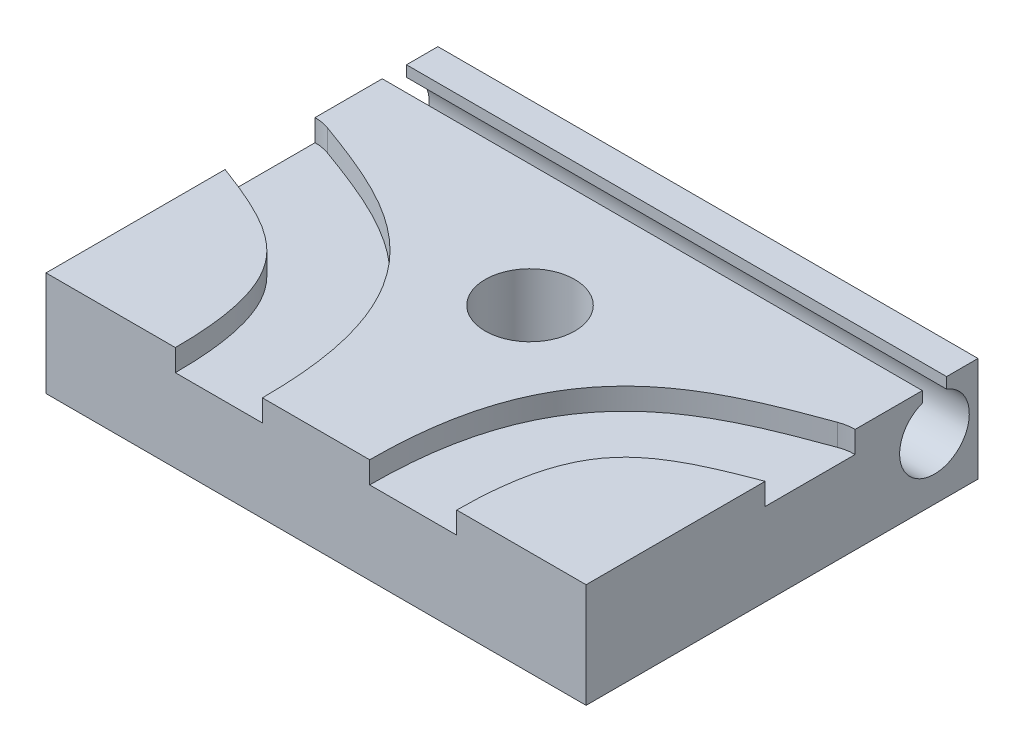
ISO-10303-21;
HEADER;
FILE_DESCRIPTION(('STEP AP214'),'2;1');
FILE_NAME('part.step','',(''),(''),'','','');
FILE_SCHEMA(('AUTOMOTIVE_DESIGN { 1 0 10303 214 1 1 1 1 }'));
ENDSEC;
DATA;
#1=APPLICATION_CONTEXT('core data for automotive mechanical design processes');
#2=APPLICATION_PROTOCOL_DEFINITION('international standard','automotive_design',2000,#1);
#3=PRODUCT_CONTEXT('',#1,'mechanical');
#4=PRODUCT('Part','Part','',(#3));
#5=PRODUCT_RELATED_PRODUCT_CATEGORY('part','',(#4));
#6=PRODUCT_DEFINITION_FORMATION('','',#4);
#7=PRODUCT_DEFINITION_CONTEXT('part definition',#1,'design');
#8=PRODUCT_DEFINITION('design','',#6,#7);
#9=PRODUCT_DEFINITION_SHAPE('','',#8);
#10=(LENGTH_UNIT() NAMED_UNIT(*) SI_UNIT(.MILLI.,.METRE.));
#11=(NAMED_UNIT(*) PLANE_ANGLE_UNIT() SI_UNIT($,.RADIAN.));
#12=(NAMED_UNIT(*) SI_UNIT($,.STERADIAN.) SOLID_ANGLE_UNIT());
#13=UNCERTAINTY_MEASURE_WITH_UNIT(LENGTH_MEASURE(1.E-05),#10,'distance_accuracy_value','');
#14=(GEOMETRIC_REPRESENTATION_CONTEXT(3) GLOBAL_UNCERTAINTY_ASSIGNED_CONTEXT((#13)) GLOBAL_UNIT_ASSIGNED_CONTEXT((#10,
#11,#12)) REPRESENTATION_CONTEXT('',''));
#15=CARTESIAN_POINT('',(0.,0.,0.));
#16=DIRECTION('',(0.,0.,1.));
#17=DIRECTION('',(1.,0.,0.));
#18=AXIS2_PLACEMENT_3D('',#15,#16,#17);
#19=CARTESIAN_POINT('',(-9.845,0.,12.7));
#20=DIRECTION('',(0.,1.,0.));
#21=DIRECTION('',(0.,0.,1.));
#22=AXIS2_PLACEMENT_3D('',#19,#20,#21);
#23=PLANE('',#22);
#24=CARTESIAN_POINT('',(9.3020430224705,0.,2.98667358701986));
#25=CARTESIAN_POINT('',(8.38461997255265,0.,3.32058826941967));
#26=CARTESIAN_POINT('',(7.00702221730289,0.,3.83323584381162));
#27=CARTESIAN_POINT('',(5.30822576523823,0.,4.81050326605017));
#28=CARTESIAN_POINT('',(4.13278039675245,0.,5.78990455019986));
#29=CARTESIAN_POINT('',(3.1519453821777,0.,7.07222009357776));
#30=CARTESIAN_POINT('',(2.4504290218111,0.,8.64272310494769));
#31=CARTESIAN_POINT('',(2.11081604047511,0.,10.1843852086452));
#32=CARTESIAN_POINT('',(1.9766890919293,0.,11.5561478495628));
#33=CARTESIAN_POINT('',(1.9544964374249,0.,12.3255067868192));
#34=CARTESIAN_POINT('',(1.9544964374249,0.,12.7));
#35=B_SPLINE_CURVE_WITH_KNOTS('',3,(#24,#25,#26,#27,#28,#29,#30,#31,#32,#33,#34),.UNSPECIFIED.,
.F.,.F.,(4,1,1,1,1,1,1,1,4),(0.,0.25,0.375,0.5,0.625,0.75,0.875,0.9375,1.),.UNSPECIFIED.);
#36=CARTESIAN_POINT('',(9.3020430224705,0.,2.98667358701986));
#37=VERTEX_POINT('',#36);
#38=CARTESIAN_POINT('',(1.9544964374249,0.,12.7));
#39=VERTEX_POINT('',#38);
#40=EDGE_CURVE('E167',#37,#39,#35,.T.);
#41=ORIENTED_EDGE('',*,*,#40,.F.);
#42=CARTESIAN_POINT('',(9.845,0.,4.47843562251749));
#43=DIRECTION('',(0.,1.,0.));
#44=DIRECTION('',(0.,0.,1.));
#45=AXIS2_PLACEMENT_3D('',#42,#43,#44);
#46=CIRCLE('',#45,1.5875);
#47=CARTESIAN_POINT('',(9.845,0.,2.89093562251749));
#48=VERTEX_POINT('',#47);
#49=EDGE_CURVE('E179',#48,#37,#46,.T.);
#50=ORIENTED_EDGE('',*,*,#49,.F.);
#51=DIRECTION('',(0.,0.,1.));
#52=VECTOR('',#51,1.);
#53=CARTESIAN_POINT('',(9.845,0.,-12.7));
#54=LINE('',#53,#52);
#55=CARTESIAN_POINT('',(9.845,0.,0.441941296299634));
#56=VERTEX_POINT('',#55);
#57=EDGE_CURVE('E283',#56,#48,#54,.T.);
#58=ORIENTED_EDGE('',*,*,#57,.F.);
#59=DIRECTION('',(1.,0.,0.));
#60=VECTOR('',#59,1.);
#61=CARTESIAN_POINT('',(-9.845,0.,0.441941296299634));
#62=LINE('',#61,#60);
#63=CARTESIAN_POINT('',(-9.845,0.,0.441941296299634));
#64=VERTEX_POINT('',#63);
#65=EDGE_CURVE('E386',#64,#56,#62,.T.);
#66=ORIENTED_EDGE('',*,*,#65,.F.);
#67=DIRECTION('',(0.,0.,1.));
#68=VECTOR('',#67,1.);
#69=CARTESIAN_POINT('',(-9.845,0.,-12.7));
#70=LINE('',#69,#68);
#71=CARTESIAN_POINT('',(-9.845,0.,2.89093562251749));
#72=VERTEX_POINT('',#71);
#73=EDGE_CURVE('E297',#64,#72,#70,.T.);
#74=ORIENTED_EDGE('',*,*,#73,.T.);
#75=CARTESIAN_POINT('',(-9.845,0.,4.47843562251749));
#76=DIRECTION('',(0.,1.,0.));
#77=DIRECTION('',(0.,0.,-1.));
#78=AXIS2_PLACEMENT_3D('',#75,#76,#77);
#79=CIRCLE('',#78,1.5875);
#80=CARTESIAN_POINT('',(-9.3020430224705,0.,2.98667358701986));
#81=VERTEX_POINT('',#80);
#82=EDGE_CURVE('E198',#81,#72,#79,.T.);
#83=ORIENTED_EDGE('',*,*,#82,.F.);
#84=CARTESIAN_POINT('',(-1.9544964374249,0.,12.7));
#85=CARTESIAN_POINT('',(-1.9544964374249,0.,12.3255067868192));
#86=CARTESIAN_POINT('',(-1.9766890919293,0.,11.5561478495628));
#87=CARTESIAN_POINT('',(-2.11081604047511,0.,10.1843852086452));
#88=CARTESIAN_POINT('',(-2.4504290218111,0.,8.64272310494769));
#89=CARTESIAN_POINT('',(-3.1519453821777,0.,7.07222009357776));
#90=CARTESIAN_POINT('',(-4.13278039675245,0.,5.78990455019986));
#91=CARTESIAN_POINT('',(-5.30822576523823,0.,4.81050326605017));
#92=CARTESIAN_POINT('',(-7.00702221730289,0.,3.83323584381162));
#93=CARTESIAN_POINT('',(-8.38461997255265,0.,3.32058826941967));
#94=CARTESIAN_POINT('',(-9.3020430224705,0.,2.98667358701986));
#95=B_SPLINE_CURVE_WITH_KNOTS('',3,(#84,#85,#86,#87,#88,#89,#90,#91,#92,#93,#94),.UNSPECIFIED.,
.F.,.F.,(4,1,1,1,1,1,1,1,4),(0.,0.0625,0.125,0.25,0.375,0.5,0.625,0.75,1.),.UNSPECIFIED.);
#96=CARTESIAN_POINT('',(-1.9544964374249,0.,12.7));
#97=VERTEX_POINT('',#96);
#98=EDGE_CURVE('E187',#97,#81,#95,.T.);
#99=ORIENTED_EDGE('',*,*,#98,.F.);
#100=DIRECTION('',(1.,0.,0.));
#101=VECTOR('',#100,1.);
#102=CARTESIAN_POINT('',(-9.845,0.,12.7));
#103=LINE('',#102,#101);
#104=EDGE_CURVE('E310',#97,#39,#103,.T.);
#105=ORIENTED_EDGE('',*,*,#104,.T.);
#106=EDGE_LOOP('',(#41,#50,#58,#66,#74,#83,#99,#105));
#107=FACE_BOUND('',#106,.T.);
#108=CARTESIAN_POINT('',(0.,0.,4.9));
#109=DIRECTION('',(0.,1.,0.));
#110=DIRECTION('',(0.,0.,1.));
#111=AXIS2_PLACEMENT_3D('',#108,#109,#110);
#112=CIRCLE('',#111,1.63194999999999);
#113=CARTESIAN_POINT('',(0.,0.,6.53194999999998));
#114=VERTEX_POINT('',#113);
#115=EDGE_CURVE('E263',#114,#114,#112,.T.);
#116=ORIENTED_EDGE('',*,*,#115,.F.);
#117=EDGE_LOOP('',(#116));
#118=FACE_BOUND('',#117,.T.);
#119=ADVANCED_FACE('F36',(#107,#118),#23,.T.);
#120=CARTESIAN_POINT('',(-10.3879569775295,0.,5.97019765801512));
#121=CARTESIAN_POINT('',(-10.1672758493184,0.,6.05051901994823));
#122=CARTESIAN_POINT('',(-9.71667349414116,0.,6.21594472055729));
#123=CARTESIAN_POINT('',(-8.89800303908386,0.,6.53203509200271));
#124=CARTESIAN_POINT('',(-7.98604656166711,0.,6.93210184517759));
#125=CARTESIAN_POINT('',(-7.10886578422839,0.,7.44495360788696));
#126=CARTESIAN_POINT('',(-6.43722224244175,0.,8.01352572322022));
#127=CARTESIAN_POINT('',(-5.91694620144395,0.,8.69319600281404));
#128=CARTESIAN_POINT('',(-5.49874899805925,0.,9.60596050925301));
#129=CARTESIAN_POINT('',(-5.25403939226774,0.,10.681628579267));
#130=CARTESIAN_POINT('',(-5.1483018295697,0.,11.7449485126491));
#131=CARTESIAN_POINT('',(-5.1294964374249,0.,12.3910522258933));
#132=CARTESIAN_POINT('',(-5.1294964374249,0.,12.7));
#133=B_SPLINE_CURVE_WITH_KNOTS('',3,(#120,#121,#122,#123,#124,#125,#126,#127,#128,#129,#130,
#131,#132),.UNSPECIFIED.,.F.,.F.,(4,1,1,1,1,1,1,1,1,1,4),(0.,0.0625,0.125,0.25,0.375,0.5,0.625,
0.75,0.875,0.9375,1.),.UNSPECIFIED.);
#134=CARTESIAN_POINT('',(-9.84499999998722,0.,6.16990247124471));
#135=VERTEX_POINT('',#134);
#136=CARTESIAN_POINT('',(-5.1294964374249,0.,12.7));
#137=VERTEX_POINT('',#136);
#138=EDGE_CURVE('E184',#135,#137,#133,.T.);
#139=ORIENTED_EDGE('',*,*,#138,.F.);
#140=CARTESIAN_POINT('',(-9.845,0.,12.7));
#141=VERTEX_POINT('',#140);
#142=EDGE_CURVE('E292',#135,#141,#70,.T.);
#143=ORIENTED_EDGE('',*,*,#142,.T.);
#144=EDGE_CURVE('E307',#141,#137,#103,.T.);
#145=ORIENTED_EDGE('',*,*,#144,.T.);
#146=EDGE_LOOP('',(#139,#143,#145));
#147=FACE_BOUND('',#146,.T.);
#148=ADVANCED_FACE('F253',(#147),#23,.T.);
#149=CARTESIAN_POINT('',(5.1294964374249,0.,12.7));
#150=CARTESIAN_POINT('',(5.1294964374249,0.,12.3910522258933));
#151=CARTESIAN_POINT('',(5.1483018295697,0.,11.7449485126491));
#152=CARTESIAN_POINT('',(5.25403939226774,0.,10.681628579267));
#153=CARTESIAN_POINT('',(5.49874899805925,0.,9.60596050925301));
#154=CARTESIAN_POINT('',(5.91694620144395,0.,8.69319600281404));
#155=CARTESIAN_POINT('',(6.43722224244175,0.,8.01352572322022));
#156=CARTESIAN_POINT('',(7.10886578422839,0.,7.44495360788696));
#157=CARTESIAN_POINT('',(7.98604656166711,0.,6.93210184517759));
#158=CARTESIAN_POINT('',(8.89800303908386,0.,6.53203509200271));
#159=CARTESIAN_POINT('',(9.71667349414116,0.,6.21594472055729));
#160=CARTESIAN_POINT('',(10.1672758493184,0.,6.05051901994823));
#161=CARTESIAN_POINT('',(10.3879569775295,0.,5.97019765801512));
#162=B_SPLINE_CURVE_WITH_KNOTS('',3,(#149,#150,#151,#152,#153,#154,#155,#156,#157,#158,#159,
#160,#161),.UNSPECIFIED.,.F.,.F.,(4,1,1,1,1,1,1,1,1,1,4),(0.,0.0625,0.125,0.25,0.375,0.5,0.625,
0.75,0.875,0.9375,1.),.UNSPECIFIED.);
#163=CARTESIAN_POINT('',(5.1294964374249,0.,12.7));
#164=VERTEX_POINT('',#163);
#165=CARTESIAN_POINT('',(9.84499999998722,0.,6.16990247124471));
#166=VERTEX_POINT('',#165);
#167=EDGE_CURVE('E326',#164,#166,#162,.T.);
#168=ORIENTED_EDGE('',*,*,#167,.F.);
#169=CARTESIAN_POINT('',(9.845,0.,12.7));
#170=VERTEX_POINT('',#169);
#171=EDGE_CURVE('E303',#164,#170,#103,.T.);
#172=ORIENTED_EDGE('',*,*,#171,.T.);
#173=EDGE_CURVE('E278',#166,#170,#54,.T.);
#174=ORIENTED_EDGE('',*,*,#173,.F.);
#175=EDGE_LOOP('',(#168,#172,#174));
#176=FACE_BOUND('',#175,.T.);
#177=ADVANCED_FACE('F245',(#176),#23,.T.);
#178=CARTESIAN_POINT('',(-9.845,-3.81,12.7));
#179=DIRECTION('',(0.,-1.,0.));
#180=DIRECTION('',(0.,0.,-1.));
#181=AXIS2_PLACEMENT_3D('',#178,#179,#180);
#182=PLANE('',#181);
#183=DIRECTION('',(1.,0.,0.));
#184=VECTOR('',#183,1.);
#185=CARTESIAN_POINT('',(-9.845,-3.81000000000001,-1.5875));
#186=LINE('',#185,#184);
#187=CARTESIAN_POINT('',(-9.845,-3.81000000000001,-1.5875));
#188=VERTEX_POINT('',#187);
#189=CARTESIAN_POINT('',(9.845,-3.81000000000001,-1.5875));
#190=VERTEX_POINT('',#189);
#191=EDGE_CURVE('E389',#188,#190,#186,.T.);
#192=ORIENTED_EDGE('',*,*,#191,.T.);
#193=DIRECTION('',(0.,0.,-1.));
#194=VECTOR('',#193,1.);
#195=CARTESIAN_POINT('',(9.845,-3.81,12.7));
#196=LINE('',#195,#194);
#197=CARTESIAN_POINT('',(9.845,-3.81,12.7));
#198=VERTEX_POINT('',#197);
#199=EDGE_CURVE('E286',#198,#190,#196,.T.);
#200=ORIENTED_EDGE('',*,*,#199,.F.);
#201=DIRECTION('',(1.,0.,0.));
#202=VECTOR('',#201,1.);
#203=CARTESIAN_POINT('',(-9.845,-3.81,12.7));
#204=LINE('',#203,#202);
#205=CARTESIAN_POINT('',(-9.845,-3.81,12.7));
#206=VERTEX_POINT('',#205);
#207=EDGE_CURVE('E304',#206,#198,#204,.T.);
#208=ORIENTED_EDGE('',*,*,#207,.F.);
#209=DIRECTION('',(0.,0.,-1.));
#210=VECTOR('',#209,1.);
#211=CARTESIAN_POINT('',(-9.845,-3.81,12.7));
#212=LINE('',#211,#210);
#213=EDGE_CURVE('E300',#206,#188,#212,.T.);
#214=ORIENTED_EDGE('',*,*,#213,.T.);
#215=EDGE_LOOP('',(#192,#200,#208,#214));
#216=FACE_BOUND('',#215,.T.);
#217=CARTESIAN_POINT('',(0.,-3.81000000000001,4.9));
#218=DIRECTION('',(0.,1.,0.));
#219=DIRECTION('',(0.,0.,1.));
#220=AXIS2_PLACEMENT_3D('',#217,#218,#219);
#221=CIRCLE('',#220,1.63195);
#222=CARTESIAN_POINT('',(0.,-3.81000000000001,6.53194999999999));
#223=VERTEX_POINT('',#222);
#224=EDGE_CURVE('E265',#223,#223,#221,.T.);
#225=ORIENTED_EDGE('',*,*,#224,.T.);
#226=EDGE_LOOP('',(#225));
#227=FACE_BOUND('',#226,.T.);
#228=ADVANCED_FACE('F243',(#216,#227),#182,.T.);
#229=CARTESIAN_POINT('',(-9.845,0.,12.7));
#230=DIRECTION('',(0.,0.,1.));
#231=DIRECTION('',(1.,0.,0.));
#232=AXIS2_PLACEMENT_3D('',#229,#230,#231);
#233=PLANE('',#232);
#234=DIRECTION('',(0.,1.,0.));
#235=VECTOR('',#234,1.);
#236=CARTESIAN_POINT('',(5.1294964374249,-0.79375,12.7));
#237=LINE('',#236,#235);
#238=CARTESIAN_POINT('',(5.1294964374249,-0.79375,12.7));
#239=VERTEX_POINT('',#238);
#240=EDGE_CURVE('E172',#239,#164,#237,.T.);
#241=ORIENTED_EDGE('',*,*,#240,.F.);
#242=DIRECTION('',(1.,0.,0.));
#243=VECTOR('',#242,1.);
#244=CARTESIAN_POINT('',(-9.845,-0.79375,12.7));
#245=LINE('',#244,#243);
#246=CARTESIAN_POINT('',(1.9544964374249,-0.79375,12.7));
#247=VERTEX_POINT('',#246);
#248=EDGE_CURVE('E176',#247,#239,#245,.T.);
#249=ORIENTED_EDGE('',*,*,#248,.F.);
#250=DIRECTION('',(0.,1.,0.));
#251=VECTOR('',#250,1.);
#252=CARTESIAN_POINT('',(1.9544964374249,-0.79375,12.7));
#253=LINE('',#252,#251);
#254=EDGE_CURVE('E161',#247,#39,#253,.T.);
#255=ORIENTED_EDGE('',*,*,#254,.T.);
#256=ORIENTED_EDGE('',*,*,#104,.F.);
#257=DIRECTION('',(0.,1.,0.));
#258=VECTOR('',#257,1.);
#259=CARTESIAN_POINT('',(-1.9544964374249,-0.79375,12.7));
#260=LINE('',#259,#258);
#261=CARTESIAN_POINT('',(-1.9544964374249,-0.79375,12.7));
#262=VERTEX_POINT('',#261);
#263=EDGE_CURVE('E358',#262,#97,#260,.T.);
#264=ORIENTED_EDGE('',*,*,#263,.F.);
#265=DIRECTION('',(-1.,0.,0.));
#266=VECTOR('',#265,1.);
#267=CARTESIAN_POINT('',(-9.845,-0.79375,12.7));
#268=LINE('',#267,#266);
#269=CARTESIAN_POINT('',(-5.1294964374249,-0.79375,12.7));
#270=VERTEX_POINT('',#269);
#271=EDGE_CURVE('E360',#262,#270,#268,.T.);
#272=ORIENTED_EDGE('',*,*,#271,.T.);
#273=DIRECTION('',(0.,1.,0.));
#274=VECTOR('',#273,1.);
#275=CARTESIAN_POINT('',(-5.1294964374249,-0.79375,12.7));
#276=LINE('',#275,#274);
#277=EDGE_CURVE('E364',#270,#137,#276,.T.);
#278=ORIENTED_EDGE('',*,*,#277,.T.);
#279=ORIENTED_EDGE('',*,*,#144,.F.);
#280=DIRECTION('',(0.,-1.,0.));
#281=VECTOR('',#280,1.);
#282=CARTESIAN_POINT('',(-9.845,0.,12.7));
#283=LINE('',#282,#281);
#284=EDGE_CURVE('E296',#141,#206,#283,.T.);
#285=ORIENTED_EDGE('',*,*,#284,.T.);
#286=ORIENTED_EDGE('',*,*,#207,.T.);
#287=DIRECTION('',(0.,-1.,0.));
#288=VECTOR('',#287,1.);
#289=CARTESIAN_POINT('',(9.845,0.,12.7));
#290=LINE('',#289,#288);
#291=EDGE_CURVE('E282',#170,#198,#290,.T.);
#292=ORIENTED_EDGE('',*,*,#291,.F.);
#293=ORIENTED_EDGE('',*,*,#171,.F.);
#294=EDGE_LOOP('',(#241,#249,#255,#256,#264,#272,#278,#279,#285,#286,#292,#293));
#295=FACE_BOUND('',#294,.T.);
#296=ADVANCED_FACE('F182',(#295),#233,.T.);
#297=DIRECTION('',(-1.,0.,0.));
#298=VECTOR('',#297,1.);
#299=CARTESIAN_POINT('',(-9.845,0.,-0.441941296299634));
#300=LINE('',#299,#298);
#301=CARTESIAN_POINT('',(9.845,0.,-0.441941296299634));
#302=VERTEX_POINT('',#301);
#303=CARTESIAN_POINT('',(-9.845,0.,-0.441941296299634));
#304=VERTEX_POINT('',#303);
#305=EDGE_CURVE('E382',#302,#304,#300,.T.);
#306=ORIENTED_EDGE('',*,*,#305,.F.);
#307=CARTESIAN_POINT('',(9.845,0.,-1.5875));
#308=VERTEX_POINT('',#307);
#309=EDGE_CURVE('E279',#308,#302,#54,.T.);
#310=ORIENTED_EDGE('',*,*,#309,.F.);
#311=DIRECTION('',(1.,0.,0.));
#312=VECTOR('',#311,1.);
#313=CARTESIAN_POINT('',(-9.845,0.,-1.5875));
#314=LINE('',#313,#312);
#315=CARTESIAN_POINT('',(-9.845,0.,-1.5875));
#316=VERTEX_POINT('',#315);
#317=EDGE_CURVE('E388',#316,#308,#314,.T.);
#318=ORIENTED_EDGE('',*,*,#317,.F.);
#319=EDGE_CURVE('E293',#316,#304,#70,.T.);
#320=ORIENTED_EDGE('',*,*,#319,.T.);
#321=EDGE_LOOP('',(#306,#310,#318,#320));
#322=FACE_BOUND('',#321,.T.);
#323=ADVANCED_FACE('F38',(#322),#23,.T.);
#324=CARTESIAN_POINT('',(-9.845,-3.81,-12.7));
#325=DIRECTION('',(1.,0.,0.));
#326=DIRECTION('',(0.,0.,-1.));
#327=AXIS2_PLACEMENT_3D('',#324,#325,#326);
#328=PLANE('',#327);
#329=ORIENTED_EDGE('',*,*,#142,.F.);
#330=DIRECTION('',(0.,1.,0.));
#331=VECTOR('',#330,1.);
#332=CARTESIAN_POINT('',(-9.845,-0.79375,6.16990247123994));
#333=LINE('',#332,#331);
#334=CARTESIAN_POINT('',(-9.84499999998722,-0.79375,6.16990247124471));
#335=VERTEX_POINT('',#334);
#336=EDGE_CURVE('E317',#135,#335,#333,.F.);
#337=ORIENTED_EDGE('',*,*,#336,.T.);
#338=DIRECTION('',(0.,0.,1.));
#339=VECTOR('',#338,1.);
#340=CARTESIAN_POINT('',(-9.845,-0.79375,-12.7));
#341=LINE('',#340,#339);
#342=CARTESIAN_POINT('',(-9.845,-0.79375,2.89093562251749));
#343=VERTEX_POINT('',#342);
#344=EDGE_CURVE('E312',#343,#335,#341,.T.);
#345=ORIENTED_EDGE('',*,*,#344,.F.);
#346=DIRECTION('',(0.,1.,0.));
#347=VECTOR('',#346,1.);
#348=CARTESIAN_POINT('',(-9.845,-0.79375,2.89093562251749));
#349=LINE('',#348,#347);
#350=EDGE_CURVE('E314',#343,#72,#349,.T.);
#351=ORIENTED_EDGE('',*,*,#350,.T.);
#352=ORIENTED_EDGE('',*,*,#73,.F.);
#353=DIRECTION('',(0.,-1.,0.));
#354=VECTOR('',#353,1.);
#355=CARTESIAN_POINT('',(-9.845,0.396875,0.441941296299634));
#356=LINE('',#355,#354);
#357=CARTESIAN_POINT('',(-9.845,-0.396875,0.441941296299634));
#358=VERTEX_POINT('',#357);
#359=EDGE_CURVE('E372',#64,#358,#356,.T.);
#360=ORIENTED_EDGE('',*,*,#359,.T.);
#361=CARTESIAN_POINT('',(-9.845,-1.5875,0.));
#362=DIRECTION('',(1.,0.,0.));
#363=DIRECTION('',(0.,0.,-1.));
#364=AXIS2_PLACEMENT_3D('',#361,#362,#363);
#365=CIRCLE('',#364,1.27);
#366=CARTESIAN_POINT('',(-9.845,-0.396875,-0.441941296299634));
#367=VERTEX_POINT('',#366);
#368=EDGE_CURVE('E289',#358,#367,#365,.T.);
#369=ORIENTED_EDGE('',*,*,#368,.T.);
#370=DIRECTION('',(0.,1.,0.));
#371=VECTOR('',#370,1.);
#372=CARTESIAN_POINT('',(-9.845,0.396875,-0.441941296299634));
#373=LINE('',#372,#371);
#374=EDGE_CURVE('E375',#367,#304,#373,.T.);
#375=ORIENTED_EDGE('',*,*,#374,.T.);
#376=ORIENTED_EDGE('',*,*,#319,.F.);
#377=DIRECTION('',(0.,1.,0.));
#378=VECTOR('',#377,1.);
#379=CARTESIAN_POINT('',(-9.845,-3.81000000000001,-1.5875));
#380=LINE('',#379,#378);
#381=EDGE_CURVE('E272',#188,#316,#380,.T.);
#382=ORIENTED_EDGE('',*,*,#381,.F.);
#383=ORIENTED_EDGE('',*,*,#213,.F.);
#384=ORIENTED_EDGE('',*,*,#284,.F.);
#385=EDGE_LOOP('',(#329,#337,#345,#351,#352,#360,#369,#375,#376,#382,#383,#384));
#386=FACE_BOUND('',#385,.T.);
#387=ADVANCED_FACE('F238',(#386),#328,.F.);
#388=CARTESIAN_POINT('',(-9.845,-1.5875,0.));
#389=DIRECTION('',(1.,0.,0.));
#390=DIRECTION('',(0.,0.,-1.));
#391=AXIS2_PLACEMENT_3D('',#388,#389,#390);
#392=CYLINDRICAL_SURFACE('',#391,1.27);
#393=CARTESIAN_POINT('',(9.845,-1.5875,0.));
#394=DIRECTION('',(1.,0.,0.));
#395=DIRECTION('',(0.,0.,-1.));
#396=AXIS2_PLACEMENT_3D('',#393,#394,#395);
#397=CIRCLE('',#396,1.27);
#398=CARTESIAN_POINT('',(9.845,-0.396875,0.441941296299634));
#399=VERTEX_POINT('',#398);
#400=CARTESIAN_POINT('',(9.845,-0.396875,-0.44194129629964));
#401=VERTEX_POINT('',#400);
#402=EDGE_CURVE('E269',#399,#401,#397,.T.);
#403=ORIENTED_EDGE('',*,*,#402,.T.);
#404=DIRECTION('',(1.,0.,0.));
#405=VECTOR('',#404,1.);
#406=CARTESIAN_POINT('',(-9.845,-0.396875,-0.441941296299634));
#407=LINE('',#406,#405);
#408=EDGE_CURVE('E380',#367,#401,#407,.T.);
#409=ORIENTED_EDGE('',*,*,#408,.F.);
#410=ORIENTED_EDGE('',*,*,#368,.F.);
#411=DIRECTION('',(1.,0.,0.));
#412=VECTOR('',#411,1.);
#413=CARTESIAN_POINT('',(-9.845,-0.396875,0.441941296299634));
#414=LINE('',#413,#412);
#415=EDGE_CURVE('E378',#358,#399,#414,.T.);
#416=ORIENTED_EDGE('',*,*,#415,.T.);
#417=EDGE_LOOP('',(#403,#409,#410,#416));
#418=FACE_BOUND('',#417,.T.);
#419=ADVANCED_FACE('F234',(#418),#392,.F.);
#420=CARTESIAN_POINT('',(9.845,-3.81,-12.7));
#421=DIRECTION('',(1.,0.,0.));
#422=DIRECTION('',(0.,0.,-1.));
#423=AXIS2_PLACEMENT_3D('',#420,#421,#422);
#424=PLANE('',#423);
#425=DIRECTION('',(0.,1.,0.));
#426=VECTOR('',#425,1.);
#427=CARTESIAN_POINT('',(9.845,-0.79375,2.89093562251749));
#428=LINE('',#427,#426);
#429=CARTESIAN_POINT('',(9.845,-0.79375,2.89093562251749));
#430=VERTEX_POINT('',#429);
#431=EDGE_CURVE('E11',#430,#48,#428,.T.);
#432=ORIENTED_EDGE('',*,*,#431,.F.);
#433=DIRECTION('',(0.,0.,-1.));
#434=VECTOR('',#433,1.);
#435=CARTESIAN_POINT('',(9.845,-0.79375,-12.7));
#436=LINE('',#435,#434);
#437=CARTESIAN_POINT('',(9.845,-0.79375,6.16990247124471));
#438=VERTEX_POINT('',#437);
#439=EDGE_CURVE('E320',#438,#430,#436,.T.);
#440=ORIENTED_EDGE('',*,*,#439,.F.);
#441=DIRECTION('',(0.,1.,0.));
#442=VECTOR('',#441,1.);
#443=CARTESIAN_POINT('',(9.84499999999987,-0.79375,6.16990247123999));
#444=LINE('',#443,#442);
#445=EDGE_CURVE('E44',#166,#438,#444,.F.);
#446=ORIENTED_EDGE('',*,*,#445,.F.);
#447=ORIENTED_EDGE('',*,*,#173,.T.);
#448=ORIENTED_EDGE('',*,*,#291,.T.);
#449=ORIENTED_EDGE('',*,*,#199,.T.);
#450=DIRECTION('',(0.,1.,0.));
#451=VECTOR('',#450,1.);
#452=CARTESIAN_POINT('',(9.845,-3.81000000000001,-1.5875));
#453=LINE('',#452,#451);
#454=EDGE_CURVE('E266',#190,#308,#453,.T.);
#455=ORIENTED_EDGE('',*,*,#454,.T.);
#456=ORIENTED_EDGE('',*,*,#309,.T.);
#457=DIRECTION('',(0.,1.,0.));
#458=VECTOR('',#457,1.);
#459=CARTESIAN_POINT('',(9.845,0.396875,-0.441941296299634));
#460=LINE('',#459,#458);
#461=EDGE_CURVE('E371',#401,#302,#460,.T.);
#462=ORIENTED_EDGE('',*,*,#461,.F.);
#463=ORIENTED_EDGE('',*,*,#402,.F.);
#464=DIRECTION('',(0.,-1.,0.));
#465=VECTOR('',#464,1.);
#466=CARTESIAN_POINT('',(9.845,-3.81,0.441941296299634));
#467=LINE('',#466,#465);
#468=EDGE_CURVE('E306',#56,#399,#467,.T.);
#469=ORIENTED_EDGE('',*,*,#468,.F.);
#470=ORIENTED_EDGE('',*,*,#57,.T.);
#471=EDGE_LOOP('',(#432,#440,#446,#447,#448,#449,#455,#456,#462,#463,#469,#470));
#472=FACE_BOUND('',#471,.T.);
#473=ADVANCED_FACE('F230',(#472),#424,.T.);
#474=CARTESIAN_POINT('',(0.,0.,4.9));
#475=DIRECTION('',(0.,1.,0.));
#476=DIRECTION('',(0.,0.,1.));
#477=AXIS2_PLACEMENT_3D('',#474,#475,#476);
#478=CYLINDRICAL_SURFACE('',#477,1.63194999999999);
#479=ORIENTED_EDGE('',*,*,#224,.F.);
#480=EDGE_LOOP('',(#479));
#481=FACE_BOUND('',#480,.T.);
#482=ORIENTED_EDGE('',*,*,#115,.T.);
#483=EDGE_LOOP('',(#482));
#484=FACE_BOUND('',#483,.T.);
#485=ADVANCED_FACE('F226',(#481,#484),#478,.F.);
#486=CARTESIAN_POINT('',(-9.845,-3.81000000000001,-1.5875));
#487=DIRECTION('',(0.,0.,1.));
#488=DIRECTION('',(1.,0.,0.));
#489=AXIS2_PLACEMENT_3D('',#486,#487,#488);
#490=PLANE('',#489);
#491=ORIENTED_EDGE('',*,*,#317,.T.);
#492=ORIENTED_EDGE('',*,*,#454,.F.);
#493=ORIENTED_EDGE('',*,*,#191,.F.);
#494=ORIENTED_EDGE('',*,*,#381,.T.);
#495=EDGE_LOOP('',(#491,#492,#493,#494));
#496=FACE_BOUND('',#495,.T.);
#497=ADVANCED_FACE('F219',(#496),#490,.F.);
#498=CARTESIAN_POINT('',(-9.845,0.396875,-0.441941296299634));
#499=DIRECTION('',(0.,0.,-1.));
#500=DIRECTION('',(-1.,0.,0.));
#501=AXIS2_PLACEMENT_3D('',#498,#499,#500);
#502=PLANE('',#501);
#503=ORIENTED_EDGE('',*,*,#305,.T.);
#504=ORIENTED_EDGE('',*,*,#374,.F.);
#505=ORIENTED_EDGE('',*,*,#408,.T.);
#506=ORIENTED_EDGE('',*,*,#461,.T.);
#507=EDGE_LOOP('',(#503,#504,#505,#506));
#508=FACE_BOUND('',#507,.T.);
#509=ADVANCED_FACE('F216',(#508),#502,.F.);
#510=CARTESIAN_POINT('',(-9.845,0.396875,0.441941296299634));
#511=DIRECTION('',(0.,0.,1.));
#512=DIRECTION('',(1.,0.,0.));
#513=AXIS2_PLACEMENT_3D('',#510,#511,#512);
#514=PLANE('',#513);
#515=ORIENTED_EDGE('',*,*,#65,.T.);
#516=ORIENTED_EDGE('',*,*,#468,.T.);
#517=ORIENTED_EDGE('',*,*,#415,.F.);
#518=ORIENTED_EDGE('',*,*,#359,.F.);
#519=EDGE_LOOP('',(#515,#516,#517,#518));
#520=FACE_BOUND('',#519,.T.);
#521=ADVANCED_FACE('F212',(#520),#514,.F.);
#522=CARTESIAN_POINT('',(-10.3879569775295,-0.79375,5.97019765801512));
#523=CARTESIAN_POINT('',(-10.1672758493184,-0.79375,6.05051901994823));
#524=CARTESIAN_POINT('',(-9.71667349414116,-0.79375,6.21594472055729));
#525=CARTESIAN_POINT('',(-8.89800303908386,-0.79375,6.53203509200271));
#526=CARTESIAN_POINT('',(-7.98604656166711,-0.79375,6.93210184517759));
#527=CARTESIAN_POINT('',(-7.10886578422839,-0.79375,7.44495360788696));
#528=CARTESIAN_POINT('',(-6.43722224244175,-0.79375,8.01352572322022));
#529=CARTESIAN_POINT('',(-5.91694620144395,-0.79375,8.69319600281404));
#530=CARTESIAN_POINT('',(-5.49874899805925,-0.79375,9.60596050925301));
#531=CARTESIAN_POINT('',(-5.25403939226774,-0.79375,10.681628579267));
#532=CARTESIAN_POINT('',(-5.1483018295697,-0.79375,11.7449485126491));
#533=CARTESIAN_POINT('',(-5.1294964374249,-0.79375,12.3910522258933));
#534=CARTESIAN_POINT('',(-5.1294964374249,-0.79375,12.7));
#535=B_SPLINE_CURVE_WITH_KNOTS('',3,(#522,#523,#524,#525,#526,#527,#528,#529,#530,#531,#532,
#533,#534),.UNSPECIFIED.,.F.,.F.,(4,1,1,1,1,1,1,1,1,1,4),(0.,0.0625,0.125,0.25,0.375,0.5,0.625,
0.75,0.875,0.9375,1.),.UNSPECIFIED.);
#536=DIRECTION('',(0.,1.,0.));
#537=VECTOR('',#536,1.);
#538=SURFACE_OF_LINEAR_EXTRUSION('',#535,#537);
#539=ORIENTED_EDGE('',*,*,#138,.T.);
#540=ORIENTED_EDGE('',*,*,#277,.F.);
#541=EDGE_CURVE('E192',#335,#270,#535,.T.);
#542=ORIENTED_EDGE('',*,*,#541,.F.);
#543=ORIENTED_EDGE('',*,*,#336,.F.);
#544=EDGE_LOOP('',(#539,#540,#542,#543));
#545=FACE_BOUND('',#544,.T.);
#546=ADVANCED_FACE('F207',(#545),#538,.F.);
#547=CARTESIAN_POINT('',(-9.845,-0.79375,4.47843562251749));
#548=DIRECTION('',(0.,1.,0.));
#549=DIRECTION('',(0.,0.,1.));
#550=AXIS2_PLACEMENT_3D('',#547,#548,#549);
#551=CYLINDRICAL_SURFACE('',#550,1.5875);
#552=CARTESIAN_POINT('',(-9.845,-0.79375,4.47843562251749));
#553=DIRECTION('',(0.,1.,0.));
#554=DIRECTION('',(0.,0.,-1.));
#555=AXIS2_PLACEMENT_3D('',#552,#553,#554);
#556=CIRCLE('',#555,1.5875);
#557=CARTESIAN_POINT('',(-9.3020430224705,-0.79375,2.98667358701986));
#558=VERTEX_POINT('',#557);
#559=EDGE_CURVE('E59',#558,#343,#556,.T.);
#560=ORIENTED_EDGE('',*,*,#559,.F.);
#561=DIRECTION('',(0.,1.,0.));
#562=VECTOR('',#561,1.);
#563=CARTESIAN_POINT('',(-9.3020430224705,-0.79375,2.98667358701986));
#564=LINE('',#563,#562);
#565=EDGE_CURVE('E363',#558,#81,#564,.T.);
#566=ORIENTED_EDGE('',*,*,#565,.T.);
#567=ORIENTED_EDGE('',*,*,#82,.T.);
#568=ORIENTED_EDGE('',*,*,#350,.F.);
#569=EDGE_LOOP('',(#560,#566,#567,#568));
#570=FACE_BOUND('',#569,.T.);
#571=ADVANCED_FACE('F211',(#570),#551,.F.);
#572=CARTESIAN_POINT('',(-6.46245015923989,-0.79375,8.03204208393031));
#573=DIRECTION('',(0.,1.,0.));
#574=DIRECTION('',(0.,0.,1.));
#575=AXIS2_PLACEMENT_3D('',#572,#573,#574);
#576=PLANE('',#575);
#577=CARTESIAN_POINT('',(-1.9544964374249,-0.79375,12.7));
#578=CARTESIAN_POINT('',(-1.9544964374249,-0.79375,12.3255067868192));
#579=CARTESIAN_POINT('',(-1.9766890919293,-0.79375,11.5561478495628));
#580=CARTESIAN_POINT('',(-2.11081604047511,-0.79375,10.1843852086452));
#581=CARTESIAN_POINT('',(-2.4504290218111,-0.79375,8.64272310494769));
#582=CARTESIAN_POINT('',(-3.1519453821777,-0.79375,7.07222009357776));
#583=CARTESIAN_POINT('',(-4.13278039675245,-0.79375,5.78990455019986));
#584=CARTESIAN_POINT('',(-5.30822576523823,-0.79375,4.81050326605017));
#585=CARTESIAN_POINT('',(-7.00702221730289,-0.79375,3.83323584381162));
#586=CARTESIAN_POINT('',(-8.38461997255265,-0.79375,3.32058826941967));
#587=CARTESIAN_POINT('',(-9.3020430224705,-0.79375,2.98667358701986));
#588=B_SPLINE_CURVE_WITH_KNOTS('',3,(#577,#578,#579,#580,#581,#582,#583,#584,#585,#586,#587),
.UNSPECIFIED.,.F.,.F.,(4,1,1,1,1,1,1,1,4),(0.,0.0625,0.125,0.25,0.375,0.5,0.625,0.75,1.),.UNSPECIFIED.);
#589=EDGE_CURVE('E197',#262,#558,#588,.T.);
#590=ORIENTED_EDGE('',*,*,#589,.T.);
#591=ORIENTED_EDGE('',*,*,#559,.T.);
#592=ORIENTED_EDGE('',*,*,#344,.T.);
#593=ORIENTED_EDGE('',*,*,#541,.T.);
#594=ORIENTED_EDGE('',*,*,#271,.F.);
#595=EDGE_LOOP('',(#590,#591,#592,#593,#594));
#596=FACE_BOUND('',#595,.T.);
#597=ADVANCED_FACE('F427',(#596),#576,.T.);
#598=DIRECTION('',(0.,1.,0.));
#599=VECTOR('',#598,1.);
#600=SURFACE_OF_LINEAR_EXTRUSION('',#588,#599);
#601=ORIENTED_EDGE('',*,*,#98,.T.);
#602=ORIENTED_EDGE('',*,*,#565,.F.);
#603=ORIENTED_EDGE('',*,*,#589,.F.);
#604=ORIENTED_EDGE('',*,*,#263,.T.);
#605=EDGE_LOOP('',(#601,#602,#603,#604));
#606=FACE_BOUND('',#605,.T.);
#607=ADVANCED_FACE('F214',(#606),#600,.F.);
#608=CARTESIAN_POINT('',(9.3020430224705,-0.79375,2.98667358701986));
#609=CARTESIAN_POINT('',(8.38461997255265,-0.79375,3.32058826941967));
#610=CARTESIAN_POINT('',(7.00702221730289,-0.79375,3.83323584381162));
#611=CARTESIAN_POINT('',(5.30822576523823,-0.79375,4.81050326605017));
#612=CARTESIAN_POINT('',(4.13278039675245,-0.79375,5.78990455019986));
#613=CARTESIAN_POINT('',(3.1519453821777,-0.79375,7.07222009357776));
#614=CARTESIAN_POINT('',(2.4504290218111,-0.79375,8.64272310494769));
#615=CARTESIAN_POINT('',(2.11081604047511,-0.79375,10.1843852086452));
#616=CARTESIAN_POINT('',(1.9766890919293,-0.79375,11.5561478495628));
#617=CARTESIAN_POINT('',(1.9544964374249,-0.79375,12.3255067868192));
#618=CARTESIAN_POINT('',(1.9544964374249,-0.79375,12.7));
#619=B_SPLINE_CURVE_WITH_KNOTS('',3,(#608,#609,#610,#611,#612,#613,#614,#615,#616,#617,#618),
.UNSPECIFIED.,.F.,.F.,(4,1,1,1,1,1,1,1,4),(0.,0.25,0.375,0.5,0.625,0.75,0.875,0.9375,1.),.UNSPECIFIED.);
#620=DIRECTION('',(0.,1.,0.));
#621=VECTOR('',#620,1.);
#622=SURFACE_OF_LINEAR_EXTRUSION('',#619,#621);
#623=ORIENTED_EDGE('',*,*,#40,.T.);
#624=ORIENTED_EDGE('',*,*,#254,.F.);
#625=CARTESIAN_POINT('',(9.3020430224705,-0.79375,2.98667358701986));
#626=VERTEX_POINT('',#625);
#627=EDGE_CURVE('E165',#626,#247,#619,.T.);
#628=ORIENTED_EDGE('',*,*,#627,.F.);
#629=DIRECTION('',(0.,1.,0.));
#630=VECTOR('',#629,1.);
#631=CARTESIAN_POINT('',(9.3020430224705,-0.79375,2.98667358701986));
#632=LINE('',#631,#630);
#633=EDGE_CURVE('E185',#626,#37,#632,.T.);
#634=ORIENTED_EDGE('',*,*,#633,.T.);
#635=EDGE_LOOP('',(#623,#624,#628,#634));
#636=FACE_BOUND('',#635,.T.);
#637=ADVANCED_FACE('F163',(#636),#622,.F.);
#638=CARTESIAN_POINT('',(9.845,-0.79375,4.47843562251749));
#639=DIRECTION('',(0.,1.,0.));
#640=DIRECTION('',(0.,0.,1.));
#641=AXIS2_PLACEMENT_3D('',#638,#639,#640);
#642=CYLINDRICAL_SURFACE('',#641,1.5875);
#643=ORIENTED_EDGE('',*,*,#431,.T.);
#644=ORIENTED_EDGE('',*,*,#49,.T.);
#645=ORIENTED_EDGE('',*,*,#633,.F.);
#646=CARTESIAN_POINT('',(9.845,-0.79375,4.47843562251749));
#647=DIRECTION('',(0.,1.,0.));
#648=DIRECTION('',(0.,0.,1.));
#649=AXIS2_PLACEMENT_3D('',#646,#647,#648);
#650=CIRCLE('',#649,1.5875);
#651=EDGE_CURVE('E173',#430,#626,#650,.T.);
#652=ORIENTED_EDGE('',*,*,#651,.F.);
#653=EDGE_LOOP('',(#643,#644,#645,#652));
#654=FACE_BOUND('',#653,.T.);
#655=ADVANCED_FACE('F332',(#654),#642,.F.);
#656=CARTESIAN_POINT('',(5.1294964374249,-0.79375,12.7));
#657=CARTESIAN_POINT('',(5.1294964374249,-0.79375,12.3910522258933));
#658=CARTESIAN_POINT('',(5.1483018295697,-0.79375,11.7449485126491));
#659=CARTESIAN_POINT('',(5.25403939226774,-0.79375,10.681628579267));
#660=CARTESIAN_POINT('',(5.49874899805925,-0.79375,9.60596050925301));
#661=CARTESIAN_POINT('',(5.91694620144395,-0.79375,8.69319600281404));
#662=CARTESIAN_POINT('',(6.43722224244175,-0.79375,8.01352572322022));
#663=CARTESIAN_POINT('',(7.10886578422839,-0.79375,7.44495360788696));
#664=CARTESIAN_POINT('',(7.98604656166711,-0.79375,6.93210184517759));
#665=CARTESIAN_POINT('',(8.89800303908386,-0.79375,6.53203509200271));
#666=CARTESIAN_POINT('',(9.71667349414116,-0.79375,6.21594472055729));
#667=CARTESIAN_POINT('',(10.1672758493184,-0.79375,6.05051901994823));
#668=CARTESIAN_POINT('',(10.3879569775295,-0.79375,5.97019765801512));
#669=B_SPLINE_CURVE_WITH_KNOTS('',3,(#656,#657,#658,#659,#660,#661,#662,#663,#664,#665,#666,
#667,#668),.UNSPECIFIED.,.F.,.F.,(4,1,1,1,1,1,1,1,1,1,4),(0.,0.0625,0.125,0.25,0.375,0.5,0.625,
0.75,0.875,0.9375,1.),.UNSPECIFIED.);
#670=DIRECTION('',(0.,1.,0.));
#671=VECTOR('',#670,1.);
#672=SURFACE_OF_LINEAR_EXTRUSION('',#669,#671);
#673=ORIENTED_EDGE('',*,*,#445,.T.);
#674=EDGE_CURVE('E51',#239,#438,#669,.T.);
#675=ORIENTED_EDGE('',*,*,#674,.F.);
#676=ORIENTED_EDGE('',*,*,#240,.T.);
#677=ORIENTED_EDGE('',*,*,#167,.T.);
#678=EDGE_LOOP('',(#673,#675,#676,#677));
#679=FACE_BOUND('',#678,.T.);
#680=ADVANCED_FACE('F324',(#679),#672,.F.);
#681=CARTESIAN_POINT('',(4.16521545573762,-0.79375,5.84039026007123));
#682=DIRECTION('',(0.,-1.,0.));
#683=DIRECTION('',(0.,0.,-1.));
#684=AXIS2_PLACEMENT_3D('',#681,#682,#683);
#685=PLANE('',#684);
#686=ORIENTED_EDGE('',*,*,#248,.T.);
#687=ORIENTED_EDGE('',*,*,#674,.T.);
#688=ORIENTED_EDGE('',*,*,#439,.T.);
#689=ORIENTED_EDGE('',*,*,#651,.T.);
#690=ORIENTED_EDGE('',*,*,#627,.T.);
#691=EDGE_LOOP('',(#686,#687,#688,#689,#690));
#692=FACE_BOUND('',#691,.T.);
#693=ADVANCED_FACE('F175',(#692),#685,.F.);
#694=CLOSED_SHELL('',(#119,#148,#177,#228,#296,#323,#387,#419,#473,#485,#497,#509,#521,#546,
#571,#597,#607,#637,#655,#680,#693));
#695=MANIFOLD_SOLID_BREP('B2',#694);
#696=ADVANCED_BREP_SHAPE_REPRESENTATION('',(#18,#695),#14);
#697=SHAPE_DEFINITION_REPRESENTATION(#9,#696);
ENDSEC;
END-ISO-10303-21;
